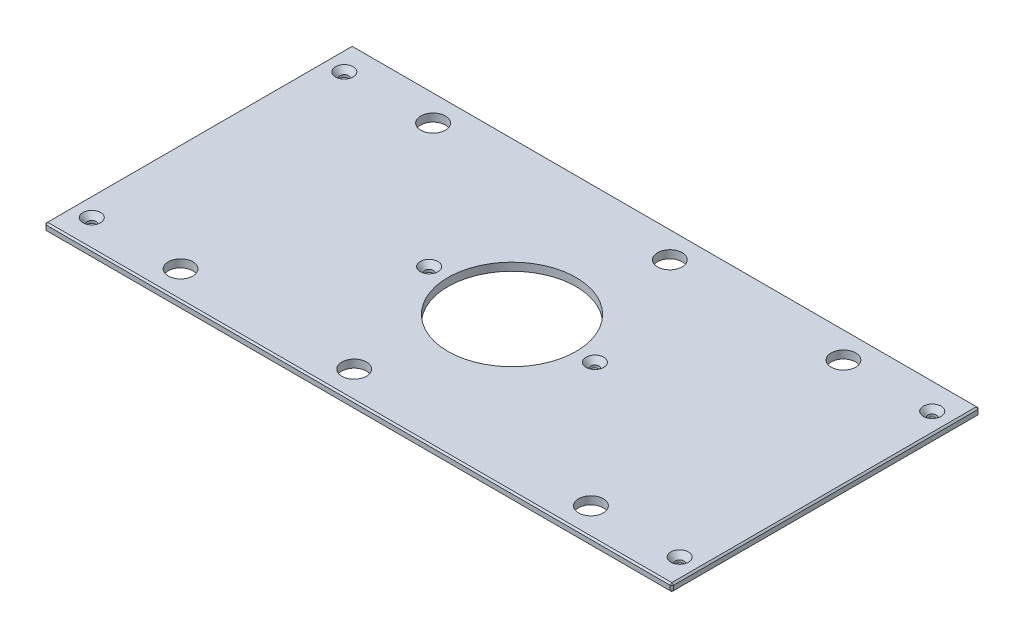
from build123d import *

# Parameters (mm, degrees)
SKETCH1_W                                     = 504.825
SKETCH1_H                                     = 247.65
BOSS_EXTRUDE1_DEPTH                           = 6.35
SKETCH13_R                                    = 51.562
CUT_EXTRUDE6_DEPTH                            = 282.220595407
F_25_32_0_78125_DIAMETER_HOLE1_D              = 19.84375
CHAMFER2_SIZE                                 = 1.27
CSK_FOR_1_4_FLAT_HEAD_MACHINE_SCREW1_AT_COUNT = 2
CSK_FOR_1_4_FLAT_HEAD_MACHINE_SCREW1_AT_PITCH = 203.2
CSK_FOR_1_4_FLAT_HEAD_MACHINE_SCREW1_2_COUNT  = 2
CSK_FOR_1_4_FLAT_HEAD_MACHINE_SCREW1_2_PITCH  = 514.869105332
CSK_FOR_1_4_FLAT_HEAD_MACHINE_SCREW1_3_COUNT  = 2
CSK_FOR_1_4_FLAT_HEAD_MACHINE_SCREW1_3_PITCH  = 319.781769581
CSK_FOR_1_4_FLAT_HEAD_MACHINE_SCREW1_4_COUNT  = 2
CSK_FOR_1_4_FLAT_HEAD_MACHINE_SCREW1_4_PITCH  = 197.92884809
CSK_FOR_1_4_FLAT_HEAD_MACHINE_SCREW1_5_COUNT  = 2
CSK_FOR_1_4_FLAT_HEAD_MACHINE_SCREW1_5_PITCH  = 473.075
CSK_FOR_1_4_FLAT_HEAD_MACHINE_SCREW1_6_COUNT  = 2
CSK_FOR_1_4_FLAT_HEAD_MACHINE_SCREW1_6_PITCH  = 401.6375
CSK_FOR_1_4_FLAT_HEAD_MACHINE_SCREW1_7_COUNT  = 2
CSK_FOR_1_4_FLAT_HEAD_MACHINE_SCREW1_7_PITCH  = 450.114342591


with BuildPart() as part:
    # Sketch1 → Boss-Extrude1 (new body)
    with BuildSketch(Plane(origin=(0, 0, 0), x_dir=(1, 0, 0), z_dir=(0, 1, 0))):
        Rectangle(SKETCH1_W, SKETCH1_H)
    extrude(amount=BOSS_EXTRUDE1_DEPTH)

    # Sketch13 → Cut-Extrude6 (cut, through all)
    with BuildSketch(Plane(origin=(0, 6.35, 0), x_dir=(1, 0, 0), z_dir=(0, 1, 0))):
        with Locations(Location((0, 0, 0), (0, 0, 270))):
            Circle(SKETCH13_R)
    extrude(amount=-CUT_EXTRUDE6_DEPTH, mode=Mode.SUBTRACT)

    # 25_32 _0.78125_ Diameter Hole1 (through all)
    with Locations(Plane(origin=(0, 6.35, 0), x_dir=(1, 0, 0), z_dir=(0, 1, 0))):
        with Locations((165.1, 101.6), (-165.1, 101.6), (165.1, -101.6), (-165.1, -101.6), (25.4, 101.6), (-25.4, -101.6)):
            Hole(F_25_32_0_78125_DIAMETER_HOLE1_D / 2)

    # Chamfer2
    chamfer2_edges = [part.edges().sort_by_distance(p)[0] for p in [
        (252.4125, 6.35, 0),
        (0, 6.35, -123.825),
        (-252.4125, 6.35, 0),
        (0, 0, -123.825),
        (252.4125, 0, 0),
        (0, 0, 123.825),
        (-252.4125, 0, 0),
        (0, 6.35, 123.825),
        (-252.4125, 3.175, -123.825),
        (252.4125, 3.175, -123.825),
        (252.4125, 3.175, 123.825),
        (-252.4125, 3.175, 123.825),
    ]]
    chamfer(chamfer2_edges, length=CHAMFER2_SIZE)

    # Sketch24 → CSK for 1_4 Flat Head Machine Screw1 (revolve, cut)
    with BuildSketch(Plane(origin=(236.5375, 6.35, -101.6), x_dir=(0, 0, 1), z_dir=(1, 0, 0))):
        Polygon((0, 0), (0, 6.35), (3.3782, 6.35), (3.3782, 4.324464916), (7.1374, 0), align=None)
    csk_for_1_4_flat_head_machine_screw1 = revolve(axis=Axis((236.5375, 12.7, -101.6), (0, -1, 0)), mode=Mode.SUBTRACT)

    # CSK for 1_4 Flat Head Machine Screw1 at: CSK for 1_4 Flat Head Machine Screw1 ×2
    with Locations(*[(0, 0, i * CSK_FOR_1_4_FLAT_HEAD_MACHINE_SCREW1_AT_PITCH) for i in range(1, CSK_FOR_1_4_FLAT_HEAD_MACHINE_SCREW1_AT_COUNT)]):
        add(csk_for_1_4_flat_head_machine_screw1, mode=Mode.SUBTRACT)

    # CSK for 1_4 Flat Head Machine Screw1 2: CSK for 1_4 Flat Head Machine Screw1 ×2
    with Locations(*[Vector(-0.9188257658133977, 0, 0.39466341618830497) * (i * CSK_FOR_1_4_FLAT_HEAD_MACHINE_SCREW1_2_PITCH) for i in range(1, CSK_FOR_1_4_FLAT_HEAD_MACHINE_SCREW1_2_COUNT)]):
        add(csk_for_1_4_flat_head_machine_screw1, mode=Mode.SUBTRACT)

    # CSK for 1_4 Flat Head Machine Screw1 3: CSK for 1_4 Flat Head Machine Screw1 ×2
    with Locations(*[Vector(-0.9481856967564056, 0, 0.31771667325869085) * (i * CSK_FOR_1_4_FLAT_HEAD_MACHINE_SCREW1_3_PITCH) for i in range(1, CSK_FOR_1_4_FLAT_HEAD_MACHINE_SCREW1_3_COUNT)]):
        add(csk_for_1_4_flat_head_machine_screw1, mode=Mode.SUBTRACT)

    # CSK for 1_4 Flat Head Machine Screw1 4: CSK for 1_4 Flat Head Machine Screw1 ×2
    with Locations(*[Vector(-0.8581998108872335, 0, 0.513315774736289) * (i * CSK_FOR_1_4_FLAT_HEAD_MACHINE_SCREW1_4_PITCH) for i in range(1, CSK_FOR_1_4_FLAT_HEAD_MACHINE_SCREW1_4_COUNT)]):
        add(csk_for_1_4_flat_head_machine_screw1, mode=Mode.SUBTRACT)

    # CSK for 1_4 Flat Head Machine Screw1 5: CSK for 1_4 Flat Head Machine Screw1 ×2
    with Locations(*[(-i * CSK_FOR_1_4_FLAT_HEAD_MACHINE_SCREW1_5_PITCH, 0, 0) for i in range(1, CSK_FOR_1_4_FLAT_HEAD_MACHINE_SCREW1_5_COUNT)]):
        add(csk_for_1_4_flat_head_machine_screw1, mode=Mode.SUBTRACT)

    # CSK for 1_4 Flat Head Machine Screw1 6: CSK for 1_4 Flat Head Machine Screw1 ×2
    with Locations(*[(-i * CSK_FOR_1_4_FLAT_HEAD_MACHINE_SCREW1_6_PITCH, 0, 0) for i in range(1, CSK_FOR_1_4_FLAT_HEAD_MACHINE_SCREW1_6_COUNT)]):
        add(csk_for_1_4_flat_head_machine_screw1, mode=Mode.SUBTRACT)

    # CSK for 1_4 Flat Head Machine Screw1 7: CSK for 1_4 Flat Head Machine Screw1 ×2
    with Locations(*[Vector(-0.8923010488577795, 0, 0.45144084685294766) * (i * CSK_FOR_1_4_FLAT_HEAD_MACHINE_SCREW1_7_PITCH) for i in range(1, CSK_FOR_1_4_FLAT_HEAD_MACHINE_SCREW1_7_COUNT)]):
        add(csk_for_1_4_flat_head_machine_screw1, mode=Mode.SUBTRACT)


solid = part.part
